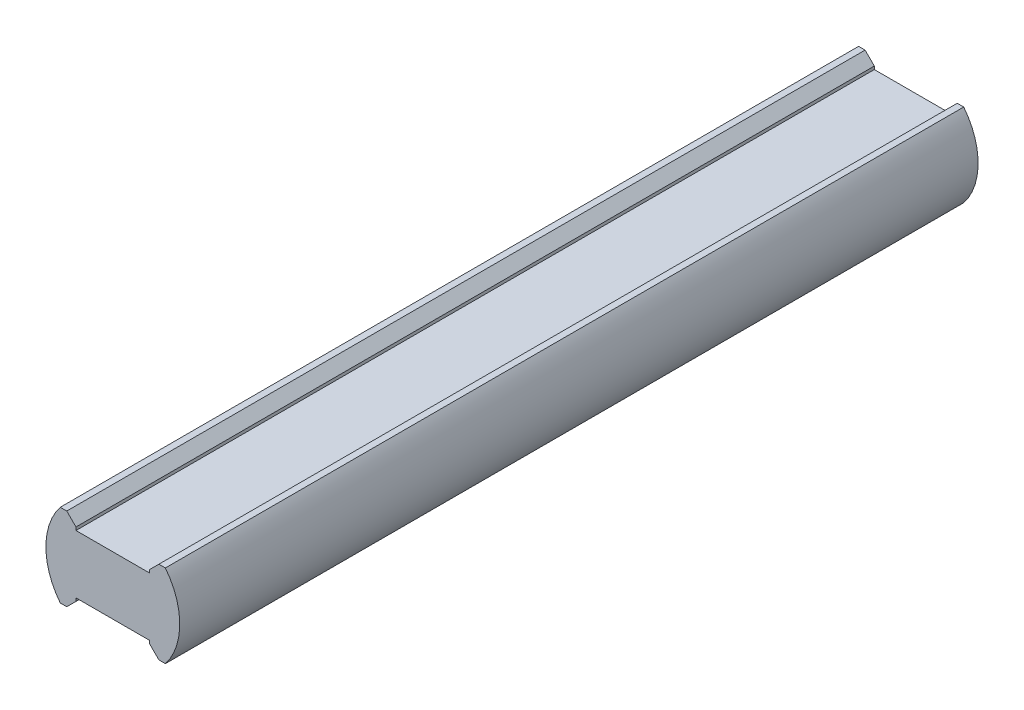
from build123d import *

# Parameters (mm, degrees)
EXTRUDE_1_DEPTH = 130


with BuildPart() as part:
    # Sketch 1 → Extrude 1 (new body)
    with BuildSketch(Plane.XY):
        with BuildLine():
            Line((-6, 5.25), (-6, 4.75))
            Line((-6, 4.75), (6, 4.75))
            Line((6, 4.75), (6, 5.25))
            Line((6, 5.25), (7.5, 6.75))
            Line((7.5, 6.75), (8.558475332, 6.75))
            ThreePointArc((8.558475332, 6.75), (9.515520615, 5.316471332), (10.234622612, 3.75))
            ThreePointArc((10.234622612, 3.75), (10.9, 0), (10.234622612, -3.75))
            ThreePointArc((10.234622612, -3.75), (9.515520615, -5.316471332), (8.558475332, -6.75))
            Line((8.558475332, -6.75), (7.5, -6.75))
            Line((7.5, -6.75), (6, -5.25))
            Line((6, -5.25), (6, -4.75))
            Line((6, -4.75), (-6, -4.75))
            Line((-6, -4.75), (-6, -5.25))
            Line((-6, -5.25), (-7.5, -6.75))
            Line((-7.5, -6.75), (-8.558475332, -6.75))
            ThreePointArc((-8.558475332, -6.75), (-9.515520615, -5.316471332), (-10.234622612, -3.75))
            ThreePointArc((-10.234622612, -3.75), (-10.9, 0), (-10.234622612, 3.75))
            ThreePointArc((-10.234622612, 3.75), (-9.515520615, 5.316471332), (-8.558475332, 6.75))
            Line((-8.558475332, 6.75), (-7.5, 6.75))
            Line((-7.5, 6.75), (-6, 5.25))
        make_face()
    extrude(amount=EXTRUDE_1_DEPTH)


solid = part.part
